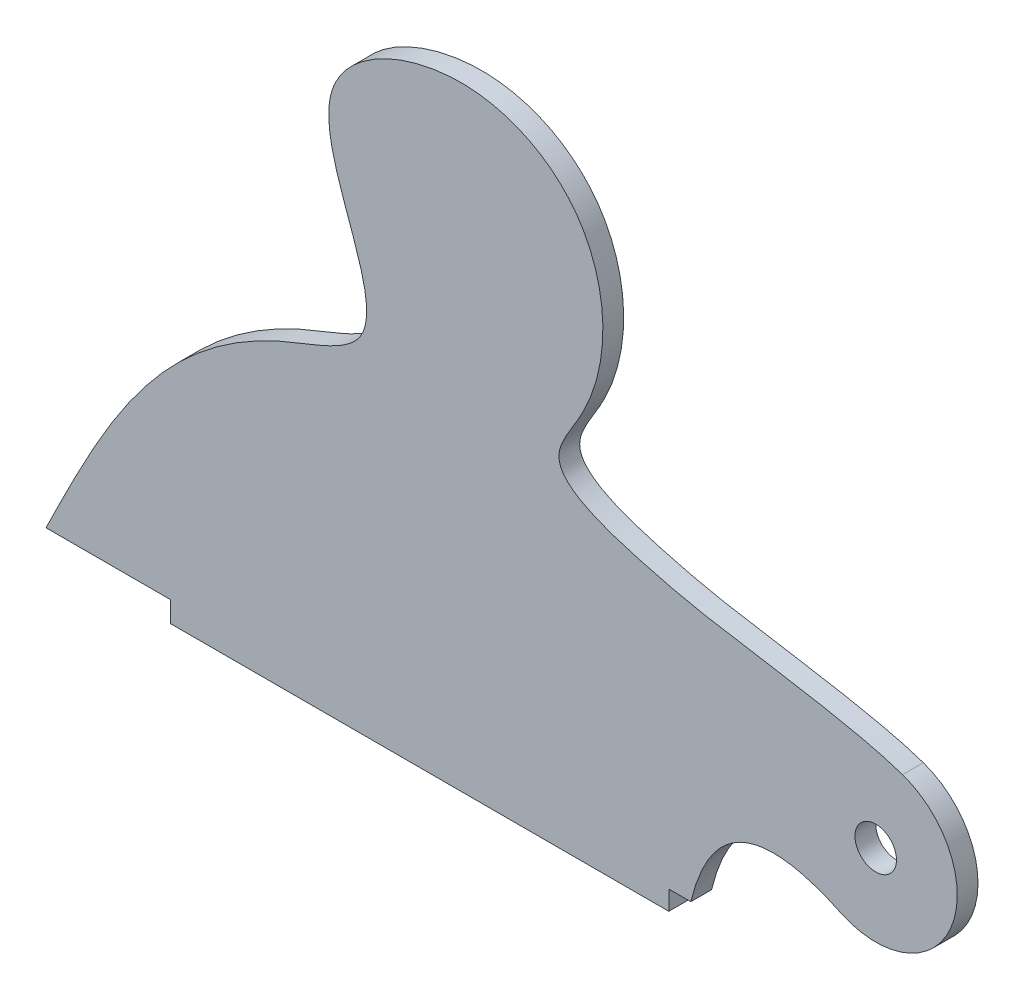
ISO-10303-21;
HEADER;
FILE_DESCRIPTION(('STEP AP214'),'2;1');
FILE_NAME('part.step','',(''),(''),'','','');
FILE_SCHEMA(('AUTOMOTIVE_DESIGN { 1 0 10303 214 1 1 1 1 }'));
ENDSEC;
DATA;
#1=APPLICATION_CONTEXT('core data for automotive mechanical design processes');
#2=APPLICATION_PROTOCOL_DEFINITION('international standard','automotive_design',2000,#1);
#3=PRODUCT_CONTEXT('',#1,'mechanical');
#4=PRODUCT('Part','Part','',(#3));
#5=PRODUCT_RELATED_PRODUCT_CATEGORY('part','',(#4));
#6=PRODUCT_DEFINITION_FORMATION('','',#4);
#7=PRODUCT_DEFINITION_CONTEXT('part definition',#1,'design');
#8=PRODUCT_DEFINITION('design','',#6,#7);
#9=PRODUCT_DEFINITION_SHAPE('','',#8);
#10=(LENGTH_UNIT() NAMED_UNIT(*) SI_UNIT(.MILLI.,.METRE.));
#11=(NAMED_UNIT(*) PLANE_ANGLE_UNIT() SI_UNIT($,.RADIAN.));
#12=(NAMED_UNIT(*) SI_UNIT($,.STERADIAN.) SOLID_ANGLE_UNIT());
#13=UNCERTAINTY_MEASURE_WITH_UNIT(LENGTH_MEASURE(1.E-05),#10,'distance_accuracy_value','');
#14=(GEOMETRIC_REPRESENTATION_CONTEXT(3) GLOBAL_UNCERTAINTY_ASSIGNED_CONTEXT((#13)) GLOBAL_UNIT_ASSIGNED_CONTEXT((#10,
#11,#12)) REPRESENTATION_CONTEXT('',''));
#15=CARTESIAN_POINT('',(0.,0.,0.));
#16=DIRECTION('',(0.,0.,1.));
#17=DIRECTION('',(1.,0.,0.));
#18=AXIS2_PLACEMENT_3D('',#15,#16,#17);
#19=CARTESIAN_POINT('',(-42.447360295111,53.4945152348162,3.175));
#20=DIRECTION('',(0.,0.,-1.));
#21=DIRECTION('',(-1.,0.,0.));
#22=AXIS2_PLACEMENT_3D('',#19,#20,#21);
#23=PLANE('',#22);
#24=CARTESIAN_POINT('',(35.7604498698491,-2.19473791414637,3.175));
#25=CARTESIAN_POINT('',(30.4174831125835,-0.326567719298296,3.175));
#26=CARTESIAN_POINT('',(10.6192367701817,2.96743150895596,3.175));
#27=CARTESIAN_POINT('',(-0.402222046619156,4.62957922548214,3.175));
#28=CARTESIAN_POINT('',(-20.4158366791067,11.0270832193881,3.175));
#29=CARTESIAN_POINT('',(-8.37893209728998,26.552466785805,3.175));
#30=CARTESIAN_POINT('',(-9.40347954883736,48.2969462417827,3.175));
#31=CARTESIAN_POINT('',(-32.3658076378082,59.3939453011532,3.175));
#32=CARTESIAN_POINT('',(-62.623390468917,45.4163731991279,3.175));
#33=CARTESIAN_POINT('',(-37.7444176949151,14.6873164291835,3.175));
#34=CARTESIAN_POINT('',(-76.4612843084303,3.27191886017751,3.175));
#35=CARTESIAN_POINT('',(-86.3745196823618,-16.9257816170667,3.175));
#36=CARTESIAN_POINT('',(-95.25,-34.9967173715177,3.175));
#37=B_SPLINE_CURVE_WITH_KNOTS('',3,(#24,#25,#26,#27,#28,#29,#30,#31,#32,#33,#34,#35,#36),
.UNSPECIFIED.,.F.,.F.,(4,1,1,1,1,1,1,1,1,1,4),(0.,0.0631379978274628,0.135028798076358,
0.189819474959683,0.218827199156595,0.320379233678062,0.391569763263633,0.478015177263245,
0.591807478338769,0.641002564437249,0.855844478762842),.UNSPECIFIED.);
#38=CARTESIAN_POINT('',(35.7604498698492,-2.19473791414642,3.175));
#39=VERTEX_POINT('',#38);
#40=CARTESIAN_POINT('',(-95.25,-34.9967173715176,3.175));
#41=VERTEX_POINT('',#40);
#42=EDGE_CURVE('E186',#39,#41,#37,.T.);
#43=ORIENTED_EDGE('',*,*,#42,.T.);
#44=DIRECTION('',(1.,0.,0.));
#45=VECTOR('',#44,1.);
#46=CARTESIAN_POINT('',(-95.25,-34.9967173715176,3.175));
#47=LINE('',#46,#45);
#48=CARTESIAN_POINT('',(-76.2,-34.9967173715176,3.175));
#49=VERTEX_POINT('',#48);
#50=EDGE_CURVE('E93',#41,#49,#47,.T.);
#51=ORIENTED_EDGE('',*,*,#50,.T.);
#52=DIRECTION('',(0.,-1.,0.));
#53=VECTOR('',#52,1.);
#54=CARTESIAN_POINT('',(-76.2,-34.9967173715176,3.175));
#55=LINE('',#54,#53);
#56=CARTESIAN_POINT('',(-76.2,-38.1717173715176,3.175));
#57=VERTEX_POINT('',#56);
#58=EDGE_CURVE('E195',#49,#57,#55,.T.);
#59=ORIENTED_EDGE('',*,*,#58,.T.);
#60=DIRECTION('',(1.,0.,0.));
#61=VECTOR('',#60,1.);
#62=CARTESIAN_POINT('',(-76.2,-38.1717173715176,3.175));
#63=LINE('',#62,#61);
#64=CARTESIAN_POINT('',(0.,-38.1717173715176,3.175));
#65=VERTEX_POINT('',#64);
#66=EDGE_CURVE('E197',#57,#65,#63,.T.);
#67=ORIENTED_EDGE('',*,*,#66,.T.);
#68=DIRECTION('',(0.,1.,0.));
#69=VECTOR('',#68,1.);
#70=CARTESIAN_POINT('',(0.,-35.2166743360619,3.175));
#71=LINE('',#70,#69);
#72=CARTESIAN_POINT('',(0.,-35.2166743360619,3.175));
#73=VERTEX_POINT('',#72);
#74=EDGE_CURVE('E112',#65,#73,#71,.T.);
#75=ORIENTED_EDGE('',*,*,#74,.T.);
#76=DIRECTION('',(1.,0.,0.));
#77=VECTOR('',#76,1.);
#78=CARTESIAN_POINT('',(0.,-35.2166743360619,3.175));
#79=LINE('',#78,#77);
#80=CARTESIAN_POINT('',(3.36864688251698,-35.2166743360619,3.175));
#81=VERTEX_POINT('',#80);
#82=EDGE_CURVE('E106',#73,#81,#79,.T.);
#83=ORIENTED_EDGE('',*,*,#82,.T.);
#84=CARTESIAN_POINT('',(3.36864688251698,-35.2166743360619,3.175));
#85=CARTESIAN_POINT('',(7.91721682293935,-16.4427412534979,3.175));
#86=CARTESIAN_POINT('',(26.3700328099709,-25.2650336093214,3.175));
#87=B_SPLINE_CURVE_WITH_KNOTS('',2,(#84,#85,#86),.UNSPECIFIED.,.F.,.F.,(3,3),(0.,1.),.UNSPECIFIED.);
#88=CARTESIAN_POINT('',(26.3700328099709,-25.2650336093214,3.175));
#89=VERTEX_POINT('',#88);
#90=EDGE_CURVE('E110',#81,#89,#87,.T.);
#91=ORIENTED_EDGE('',*,*,#90,.T.);
#92=CARTESIAN_POINT('',(31.6447112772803,-13.9657502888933,3.175));
#93=DIRECTION('',(0.,0.,1.));
#94=DIRECTION('',(1.,0.,0.));
#95=AXIS2_PLACEMENT_3D('',#92,#93,#94);
#96=CIRCLE('',#95,12.469804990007);
#97=EDGE_CURVE('E50',#89,#39,#96,.T.);
#98=ORIENTED_EDGE('',*,*,#97,.T.);
#99=EDGE_LOOP('',(#43,#51,#59,#67,#75,#83,#91,#98));
#100=FACE_BOUND('',#99,.T.);
#101=CARTESIAN_POINT('',(31.6447112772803,-13.9657502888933,3.175));
#102=DIRECTION('',(0.,0.,1.));
#103=DIRECTION('',(1.,0.,0.));
#104=AXIS2_PLACEMENT_3D('',#101,#102,#103);
#105=CIRCLE('',#104,3.17499999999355);
#106=CARTESIAN_POINT('',(34.8197112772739,-13.9657502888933,3.175));
#107=VERTEX_POINT('',#106);
#108=EDGE_CURVE('E178',#107,#107,#105,.T.);
#109=ORIENTED_EDGE('',*,*,#108,.F.);
#110=EDGE_LOOP('',(#109));
#111=FACE_BOUND('',#110,.T.);
#112=ADVANCED_FACE('F32',(#100,#111),#23,.F.);
#113=CARTESIAN_POINT('',(-42.447360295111,53.4945152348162,0.));
#114=DIRECTION('',(0.,0.,-1.));
#115=DIRECTION('',(-1.,0.,0.));
#116=AXIS2_PLACEMENT_3D('',#113,#114,#115);
#117=PLANE('',#116);
#118=CARTESIAN_POINT('',(35.7604498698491,-2.19473791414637,0.));
#119=CARTESIAN_POINT('',(30.4174831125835,-0.326567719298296,0.));
#120=CARTESIAN_POINT('',(10.6192367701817,2.96743150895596,0.));
#121=CARTESIAN_POINT('',(-0.402222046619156,4.62957922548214,0.));
#122=CARTESIAN_POINT('',(-20.4158366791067,11.0270832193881,0.));
#123=CARTESIAN_POINT('',(-8.37893209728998,26.552466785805,0.));
#124=CARTESIAN_POINT('',(-9.40347954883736,48.2969462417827,0.));
#125=CARTESIAN_POINT('',(-32.3658076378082,59.3939453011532,0.));
#126=CARTESIAN_POINT('',(-62.623390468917,45.4163731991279,0.));
#127=CARTESIAN_POINT('',(-37.7444176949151,14.6873164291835,0.));
#128=CARTESIAN_POINT('',(-76.4612843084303,3.27191886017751,0.));
#129=CARTESIAN_POINT('',(-86.3745196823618,-16.9257816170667,0.));
#130=CARTESIAN_POINT('',(-95.25,-34.9967173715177,0.));
#131=B_SPLINE_CURVE_WITH_KNOTS('',3,(#118,#119,#120,#121,#122,#123,#124,#125,#126,#127,#128,
#129,#130),.UNSPECIFIED.,.F.,.F.,(4,1,1,1,1,1,1,1,1,1,4),(0.,0.0631379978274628,
0.135028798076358,0.189819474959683,0.218827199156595,0.320379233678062,0.391569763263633,
0.478015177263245,0.591807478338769,0.641002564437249,0.855844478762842),.UNSPECIFIED.);
#132=CARTESIAN_POINT('',(35.7604498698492,-2.19473791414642,0.));
#133=VERTEX_POINT('',#132);
#134=CARTESIAN_POINT('',(-95.25,-34.9967173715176,0.));
#135=VERTEX_POINT('',#134);
#136=EDGE_CURVE('E184',#133,#135,#131,.T.);
#137=ORIENTED_EDGE('',*,*,#136,.F.);
#138=CARTESIAN_POINT('',(31.6447112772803,-13.9657502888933,0.));
#139=DIRECTION('',(0.,0.,1.));
#140=DIRECTION('',(1.,0.,0.));
#141=AXIS2_PLACEMENT_3D('',#138,#139,#140);
#142=CIRCLE('',#141,12.469804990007);
#143=CARTESIAN_POINT('',(26.3700328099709,-25.2650336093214,0.));
#144=VERTEX_POINT('',#143);
#145=EDGE_CURVE('E85',#144,#133,#142,.T.);
#146=ORIENTED_EDGE('',*,*,#145,.F.);
#147=CARTESIAN_POINT('',(3.36864688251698,-35.2166743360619,0.));
#148=CARTESIAN_POINT('',(7.91721682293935,-16.4427412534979,0.));
#149=CARTESIAN_POINT('',(26.3700328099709,-25.2650336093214,0.));
#150=B_SPLINE_CURVE_WITH_KNOTS('',2,(#147,#148,#149),.UNSPECIFIED.,.F.,.F.,(3,3),(0.,1.),.UNSPECIFIED.);
#151=CARTESIAN_POINT('',(3.36864688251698,-35.2166743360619,0.));
#152=VERTEX_POINT('',#151);
#153=EDGE_CURVE('E79',#152,#144,#150,.T.);
#154=ORIENTED_EDGE('',*,*,#153,.F.);
#155=DIRECTION('',(1.,0.,0.));
#156=VECTOR('',#155,1.);
#157=CARTESIAN_POINT('',(0.,-35.2166743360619,0.));
#158=LINE('',#157,#156);
#159=CARTESIAN_POINT('',(0.,-35.2166743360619,0.));
#160=VERTEX_POINT('',#159);
#161=EDGE_CURVE('E120',#160,#152,#158,.T.);
#162=ORIENTED_EDGE('',*,*,#161,.F.);
#163=DIRECTION('',(0.,1.,0.));
#164=VECTOR('',#163,1.);
#165=CARTESIAN_POINT('',(0.,-35.2166743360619,0.));
#166=LINE('',#165,#164);
#167=CARTESIAN_POINT('',(0.,-38.1717173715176,0.));
#168=VERTEX_POINT('',#167);
#169=EDGE_CURVE('E210',#168,#160,#166,.T.);
#170=ORIENTED_EDGE('',*,*,#169,.F.);
#171=DIRECTION('',(1.,0.,0.));
#172=VECTOR('',#171,1.);
#173=CARTESIAN_POINT('',(-76.2,-38.1717173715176,0.));
#174=LINE('',#173,#172);
#175=CARTESIAN_POINT('',(-76.2,-38.1717173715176,0.));
#176=VERTEX_POINT('',#175);
#177=EDGE_CURVE('E206',#176,#168,#174,.T.);
#178=ORIENTED_EDGE('',*,*,#177,.F.);
#179=DIRECTION('',(0.,-1.,0.));
#180=VECTOR('',#179,1.);
#181=CARTESIAN_POINT('',(-76.2,-34.9967173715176,0.));
#182=LINE('',#181,#180);
#183=CARTESIAN_POINT('',(-76.2,-34.9967173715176,0.));
#184=VERTEX_POINT('',#183);
#185=EDGE_CURVE('E216',#184,#176,#182,.T.);
#186=ORIENTED_EDGE('',*,*,#185,.F.);
#187=DIRECTION('',(1.,0.,0.));
#188=VECTOR('',#187,1.);
#189=CARTESIAN_POINT('',(-95.25,-34.9967173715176,0.));
#190=LINE('',#189,#188);
#191=EDGE_CURVE('E218',#135,#184,#190,.T.);
#192=ORIENTED_EDGE('',*,*,#191,.F.);
#193=EDGE_LOOP('',(#137,#146,#154,#162,#170,#178,#186,#192));
#194=FACE_BOUND('',#193,.T.);
#195=CARTESIAN_POINT('',(31.6447112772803,-13.9657502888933,0.));
#196=DIRECTION('',(0.,0.,1.));
#197=DIRECTION('',(1.,0.,0.));
#198=AXIS2_PLACEMENT_3D('',#195,#196,#197);
#199=CIRCLE('',#198,3.17499999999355);
#200=CARTESIAN_POINT('',(34.8197112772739,-13.9657502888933,0.));
#201=VERTEX_POINT('',#200);
#202=EDGE_CURVE('E181',#201,#201,#199,.T.);
#203=ORIENTED_EDGE('',*,*,#202,.T.);
#204=EDGE_LOOP('',(#203));
#205=FACE_BOUND('',#204,.T.);
#206=ADVANCED_FACE('F160',(#194,#205),#117,.T.);
#207=DIRECTION('',(0.,0.,-1.));
#208=VECTOR('',#207,1.);
#209=SURFACE_OF_LINEAR_EXTRUSION('',#37,#208);
#210=ORIENTED_EDGE('',*,*,#136,.T.);
#211=DIRECTION('',(0.,0.,-1.));
#212=VECTOR('',#211,1.);
#213=CARTESIAN_POINT('',(-95.25,-34.9967173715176,3.175));
#214=LINE('',#213,#212);
#215=EDGE_CURVE('E11',#41,#135,#214,.T.);
#216=ORIENTED_EDGE('',*,*,#215,.F.);
#217=ORIENTED_EDGE('',*,*,#42,.F.);
#218=DIRECTION('',(0.,0.,-1.));
#219=VECTOR('',#218,1.);
#220=CARTESIAN_POINT('',(35.7604498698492,-2.19473791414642,3.175));
#221=LINE('',#220,#219);
#222=EDGE_CURVE('E126',#39,#133,#221,.T.);
#223=ORIENTED_EDGE('',*,*,#222,.T.);
#224=EDGE_LOOP('',(#210,#216,#217,#223));
#225=FACE_BOUND('',#224,.T.);
#226=ADVANCED_FACE('F34',(#225),#209,.F.);
#227=CARTESIAN_POINT('',(-95.25,-34.9967173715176,3.175));
#228=DIRECTION('',(0.,1.,0.));
#229=DIRECTION('',(0.,0.,1.));
#230=AXIS2_PLACEMENT_3D('',#227,#228,#229);
#231=PLANE('',#230);
#232=ORIENTED_EDGE('',*,*,#191,.T.);
#233=DIRECTION('',(0.,0.,-1.));
#234=VECTOR('',#233,1.);
#235=CARTESIAN_POINT('',(-76.2,-34.9967173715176,3.175));
#236=LINE('',#235,#234);
#237=EDGE_CURVE('E42',#49,#184,#236,.T.);
#238=ORIENTED_EDGE('',*,*,#237,.F.);
#239=ORIENTED_EDGE('',*,*,#50,.F.);
#240=ORIENTED_EDGE('',*,*,#215,.T.);
#241=EDGE_LOOP('',(#232,#238,#239,#240));
#242=FACE_BOUND('',#241,.T.);
#243=ADVANCED_FACE('F154',(#242),#231,.F.);
#244=CARTESIAN_POINT('',(-76.2,-34.9967173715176,3.175));
#245=DIRECTION('',(1.,0.,0.));
#246=DIRECTION('',(0.,0.,-1.));
#247=AXIS2_PLACEMENT_3D('',#244,#245,#246);
#248=PLANE('',#247);
#249=ORIENTED_EDGE('',*,*,#185,.T.);
#250=DIRECTION('',(0.,0.,-1.));
#251=VECTOR('',#250,1.);
#252=CARTESIAN_POINT('',(-76.2,-38.1717173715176,3.175));
#253=LINE('',#252,#251);
#254=EDGE_CURVE('E208',#57,#176,#253,.T.);
#255=ORIENTED_EDGE('',*,*,#254,.F.);
#256=ORIENTED_EDGE('',*,*,#58,.F.);
#257=ORIENTED_EDGE('',*,*,#237,.T.);
#258=EDGE_LOOP('',(#249,#255,#256,#257));
#259=FACE_BOUND('',#258,.T.);
#260=ADVANCED_FACE('F151',(#259),#248,.F.);
#261=CARTESIAN_POINT('',(-76.2,-38.1717173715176,3.175));
#262=DIRECTION('',(0.,1.,0.));
#263=DIRECTION('',(0.,0.,1.));
#264=AXIS2_PLACEMENT_3D('',#261,#262,#263);
#265=PLANE('',#264);
#266=ORIENTED_EDGE('',*,*,#177,.T.);
#267=DIRECTION('',(0.,0.,-1.));
#268=VECTOR('',#267,1.);
#269=CARTESIAN_POINT('',(0.,-38.1717173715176,3.175));
#270=LINE('',#269,#268);
#271=EDGE_CURVE('E204',#65,#168,#270,.T.);
#272=ORIENTED_EDGE('',*,*,#271,.F.);
#273=ORIENTED_EDGE('',*,*,#66,.F.);
#274=ORIENTED_EDGE('',*,*,#254,.T.);
#275=EDGE_LOOP('',(#266,#272,#273,#274));
#276=FACE_BOUND('',#275,.T.);
#277=ADVANCED_FACE('F147',(#276),#265,.F.);
#278=CARTESIAN_POINT('',(0.,-35.2166743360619,3.175));
#279=DIRECTION('',(-1.,0.,0.));
#280=DIRECTION('',(0.,-1.,0.));
#281=AXIS2_PLACEMENT_3D('',#278,#279,#280);
#282=PLANE('',#281);
#283=ORIENTED_EDGE('',*,*,#169,.T.);
#284=DIRECTION('',(0.,0.,-1.));
#285=VECTOR('',#284,1.);
#286=CARTESIAN_POINT('',(0.,-35.2166743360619,3.175));
#287=LINE('',#286,#285);
#288=EDGE_CURVE('E121',#73,#160,#287,.T.);
#289=ORIENTED_EDGE('',*,*,#288,.F.);
#290=ORIENTED_EDGE('',*,*,#74,.F.);
#291=ORIENTED_EDGE('',*,*,#271,.T.);
#292=EDGE_LOOP('',(#283,#289,#290,#291));
#293=FACE_BOUND('',#292,.T.);
#294=ADVANCED_FACE('F144',(#293),#282,.F.);
#295=CARTESIAN_POINT('',(0.,-35.2166743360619,3.175));
#296=DIRECTION('',(0.,1.,0.));
#297=DIRECTION('',(0.,0.,1.));
#298=AXIS2_PLACEMENT_3D('',#295,#296,#297);
#299=PLANE('',#298);
#300=ORIENTED_EDGE('',*,*,#161,.T.);
#301=DIRECTION('',(0.,0.,-1.));
#302=VECTOR('',#301,1.);
#303=CARTESIAN_POINT('',(3.36864688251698,-35.2166743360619,3.175));
#304=LINE('',#303,#302);
#305=EDGE_CURVE('E117',#81,#152,#304,.T.);
#306=ORIENTED_EDGE('',*,*,#305,.F.);
#307=ORIENTED_EDGE('',*,*,#82,.F.);
#308=ORIENTED_EDGE('',*,*,#288,.T.);
#309=EDGE_LOOP('',(#300,#306,#307,#308));
#310=FACE_BOUND('',#309,.T.);
#311=ADVANCED_FACE('F118',(#310),#299,.F.);
#312=DIRECTION('',(0.,0.,-1.));
#313=VECTOR('',#312,1.);
#314=SURFACE_OF_LINEAR_EXTRUSION('',#87,#313);
#315=ORIENTED_EDGE('',*,*,#153,.T.);
#316=DIRECTION('',(0.,0.,-1.));
#317=VECTOR('',#316,1.);
#318=CARTESIAN_POINT('',(26.3700328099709,-25.2650336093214,3.175));
#319=LINE('',#318,#317);
#320=EDGE_CURVE('E122',#89,#144,#319,.T.);
#321=ORIENTED_EDGE('',*,*,#320,.F.);
#322=ORIENTED_EDGE('',*,*,#90,.F.);
#323=ORIENTED_EDGE('',*,*,#305,.T.);
#324=EDGE_LOOP('',(#315,#321,#322,#323));
#325=FACE_BOUND('',#324,.T.);
#326=ADVANCED_FACE('F124',(#325),#314,.F.);
#327=CARTESIAN_POINT('',(31.6447112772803,-13.9657502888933,3.175));
#328=DIRECTION('',(0.,0.,-1.));
#329=DIRECTION('',(-1.,0.,0.));
#330=AXIS2_PLACEMENT_3D('',#327,#328,#329);
#331=CYLINDRICAL_SURFACE('',#330,12.469804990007);
#332=ORIENTED_EDGE('',*,*,#145,.T.);
#333=ORIENTED_EDGE('',*,*,#222,.F.);
#334=ORIENTED_EDGE('',*,*,#97,.F.);
#335=ORIENTED_EDGE('',*,*,#320,.T.);
#336=EDGE_LOOP('',(#332,#333,#334,#335));
#337=FACE_BOUND('',#336,.T.);
#338=ADVANCED_FACE('F140',(#337),#331,.T.);
#339=CARTESIAN_POINT('',(31.6447112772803,-13.9657502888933,3.175));
#340=DIRECTION('',(0.,0.,-1.));
#341=DIRECTION('',(-1.,0.,0.));
#342=AXIS2_PLACEMENT_3D('',#339,#340,#341);
#343=CYLINDRICAL_SURFACE('',#342,3.17499999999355);
#344=ORIENTED_EDGE('',*,*,#108,.T.);
#345=EDGE_LOOP('',(#344));
#346=FACE_BOUND('',#345,.T.);
#347=ORIENTED_EDGE('',*,*,#202,.F.);
#348=EDGE_LOOP('',(#347));
#349=FACE_BOUND('',#348,.T.);
#350=ADVANCED_FACE('F169',(#346,#349),#343,.F.);
#351=CLOSED_SHELL('',(#112,#206,#226,#243,#260,#277,#294,#311,#326,#338,#350));
#352=MANIFOLD_SOLID_BREP('B2',#351);
#353=ADVANCED_BREP_SHAPE_REPRESENTATION('',(#18,#352),#14);
#354=SHAPE_DEFINITION_REPRESENTATION(#9,#353);
ENDSEC;
END-ISO-10303-21;
